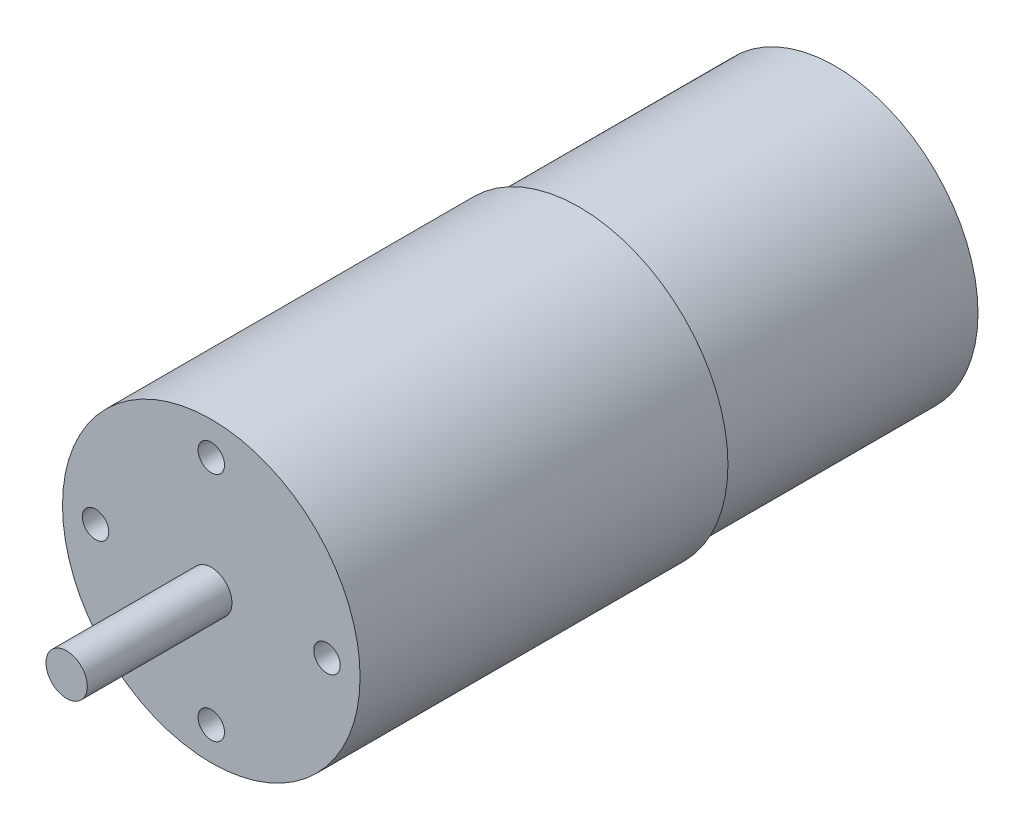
ISO-10303-21;
HEADER;
FILE_DESCRIPTION(('STEP AP214'),'2;1');
FILE_NAME('part.step','',(''),(''),'','','');
FILE_SCHEMA(('AUTOMOTIVE_DESIGN { 1 0 10303 214 1 1 1 1 }'));
ENDSEC;
DATA;
#1=APPLICATION_CONTEXT('core data for automotive mechanical design processes');
#2=APPLICATION_PROTOCOL_DEFINITION('international standard','automotive_design',2000,#1);
#3=PRODUCT_CONTEXT('',#1,'mechanical');
#4=PRODUCT('Part','Part','',(#3));
#5=PRODUCT_RELATED_PRODUCT_CATEGORY('part','',(#4));
#6=PRODUCT_DEFINITION_FORMATION('','',#4);
#7=PRODUCT_DEFINITION_CONTEXT('part definition',#1,'design');
#8=PRODUCT_DEFINITION('design','',#6,#7);
#9=PRODUCT_DEFINITION_SHAPE('','',#8);
#10=(LENGTH_UNIT() NAMED_UNIT(*) SI_UNIT(.MILLI.,.METRE.));
#11=(NAMED_UNIT(*) PLANE_ANGLE_UNIT() SI_UNIT($,.RADIAN.));
#12=(NAMED_UNIT(*) SI_UNIT($,.STERADIAN.) SOLID_ANGLE_UNIT());
#13=UNCERTAINTY_MEASURE_WITH_UNIT(LENGTH_MEASURE(1.E-05),#10,'distance_accuracy_value','');
#14=(GEOMETRIC_REPRESENTATION_CONTEXT(3) GLOBAL_UNCERTAINTY_ASSIGNED_CONTEXT((#13)) GLOBAL_UNIT_ASSIGNED_CONTEXT((#10,
#11,#12)) REPRESENTATION_CONTEXT('',''));
#15=CARTESIAN_POINT('',(0.,0.,0.));
#16=DIRECTION('',(0.,0.,1.));
#17=DIRECTION('',(1.,0.,0.));
#18=AXIS2_PLACEMENT_3D('',#15,#16,#17);
#19=CARTESIAN_POINT('',(0.,0.,0.));
#20=DIRECTION('',(0.,0.,1.));
#21=DIRECTION('',(1.,0.,0.));
#22=AXIS2_PLACEMENT_3D('',#19,#20,#21);
#23=PLANE('',#22);
#24=DIRECTION('',(0.,-1.,0.));
#25=VECTOR('',#24,1.);
#26=CARTESIAN_POINT('',(-11.,0.5,0.));
#27=LINE('',#26,#25);
#28=CARTESIAN_POINT('',(-11.,0.5,0.));
#29=VERTEX_POINT('',#28);
#30=CARTESIAN_POINT('',(-11.,-0.5,0.));
#31=VERTEX_POINT('',#30);
#32=EDGE_CURVE('E157',#29,#31,#27,.T.);
#33=ORIENTED_EDGE('',*,*,#32,.T.);
#34=DIRECTION('',(1.,0.,0.));
#35=VECTOR('',#34,1.);
#36=CARTESIAN_POINT('',(-11.,-0.5,0.));
#37=LINE('',#36,#35);
#38=CARTESIAN_POINT('',(-9.,-0.5,0.));
#39=VERTEX_POINT('',#38);
#40=EDGE_CURVE('E149',#31,#39,#37,.T.);
#41=ORIENTED_EDGE('',*,*,#40,.T.);
#42=DIRECTION('',(0.,-1.,0.));
#43=VECTOR('',#42,1.);
#44=CARTESIAN_POINT('',(-9.,0.5,0.));
#45=LINE('',#44,#43);
#46=CARTESIAN_POINT('',(-9.,0.5,0.));
#47=VERTEX_POINT('',#46);
#48=EDGE_CURVE('E154',#47,#39,#45,.T.);
#49=ORIENTED_EDGE('',*,*,#48,.F.);
#50=DIRECTION('',(1.,0.,0.));
#51=VECTOR('',#50,1.);
#52=CARTESIAN_POINT('',(-11.,0.5,0.));
#53=LINE('',#52,#51);
#54=EDGE_CURVE('E138',#29,#47,#53,.T.);
#55=ORIENTED_EDGE('',*,*,#54,.F.);
#56=EDGE_LOOP('',(#33,#41,#49,#55));
#57=FACE_BOUND('',#56,.T.);
#58=CARTESIAN_POINT('',(0.,0.,0.));
#59=DIRECTION('',(0.,0.,1.));
#60=DIRECTION('',(1.,0.,0.));
#61=AXIS2_PLACEMENT_3D('',#58,#59,#60);
#62=CIRCLE('',#61,17.25);
#63=CARTESIAN_POINT('',(17.25,0.,0.));
#64=VERTEX_POINT('',#63);
#65=EDGE_CURVE('E38',#64,#64,#62,.T.);
#66=ORIENTED_EDGE('',*,*,#65,.F.);
#67=EDGE_LOOP('',(#66));
#68=FACE_BOUND('',#67,.T.);
#69=DIRECTION('',(0.,-1.,0.));
#70=VECTOR('',#69,1.);
#71=CARTESIAN_POINT('',(9.,0.5,0.));
#72=LINE('',#71,#70);
#73=CARTESIAN_POINT('',(9.,0.5,0.));
#74=VERTEX_POINT('',#73);
#75=CARTESIAN_POINT('',(9.,-0.5,0.));
#76=VERTEX_POINT('',#75);
#77=EDGE_CURVE('E54',#74,#76,#72,.T.);
#78=ORIENTED_EDGE('',*,*,#77,.T.);
#79=DIRECTION('',(1.,0.,0.));
#80=VECTOR('',#79,1.);
#81=CARTESIAN_POINT('',(11.,-0.5,0.));
#82=LINE('',#81,#80);
#83=CARTESIAN_POINT('',(11.,-0.5,0.));
#84=VERTEX_POINT('',#83);
#85=EDGE_CURVE('E478',#76,#84,#82,.T.);
#86=ORIENTED_EDGE('',*,*,#85,.T.);
#87=DIRECTION('',(0.,-1.,0.));
#88=VECTOR('',#87,1.);
#89=CARTESIAN_POINT('',(11.,0.5,0.));
#90=LINE('',#89,#88);
#91=CARTESIAN_POINT('',(11.,0.5,0.));
#92=VERTEX_POINT('',#91);
#93=EDGE_CURVE('E124',#92,#84,#90,.T.);
#94=ORIENTED_EDGE('',*,*,#93,.F.);
#95=DIRECTION('',(1.,0.,0.));
#96=VECTOR('',#95,1.);
#97=CARTESIAN_POINT('',(11.,0.5,0.));
#98=LINE('',#97,#96);
#99=EDGE_CURVE('E49',#74,#92,#98,.T.);
#100=ORIENTED_EDGE('',*,*,#99,.F.);
#101=EDGE_LOOP('',(#78,#86,#94,#100));
#102=FACE_BOUND('',#101,.T.);
#103=ADVANCED_FACE('F34',(#57,#68,#102),#23,.F.);
#104=CARTESIAN_POINT('',(0.,0.,31.));
#105=DIRECTION('',(0.,0.,-1.));
#106=DIRECTION('',(-1.,0.,0.));
#107=AXIS2_PLACEMENT_3D('',#104,#105,#106);
#108=CYLINDRICAL_SURFACE('',#107,17.25);
#109=CARTESIAN_POINT('',(0.,0.,31.));
#110=DIRECTION('',(0.,0.,1.));
#111=DIRECTION('',(1.,0.,0.));
#112=AXIS2_PLACEMENT_3D('',#109,#110,#111);
#113=CIRCLE('',#112,17.25);
#114=CARTESIAN_POINT('',(17.25,0.,31.));
#115=VERTEX_POINT('',#114);
#116=EDGE_CURVE('E11',#115,#115,#113,.T.);
#117=ORIENTED_EDGE('',*,*,#116,.F.);
#118=EDGE_LOOP('',(#117));
#119=FACE_BOUND('',#118,.T.);
#120=ORIENTED_EDGE('',*,*,#65,.T.);
#121=EDGE_LOOP('',(#120));
#122=FACE_BOUND('',#121,.T.);
#123=ADVANCED_FACE('F36',(#119,#122),#108,.T.);
#124=CARTESIAN_POINT('',(0.,0.,75.5));
#125=DIRECTION('',(0.,0.,-1.));
#126=DIRECTION('',(-1.,0.,0.));
#127=AXIS2_PLACEMENT_3D('',#124,#125,#126);
#128=CYLINDRICAL_SURFACE('',#127,18.);
#129=CARTESIAN_POINT('',(0.,0.,75.5));
#130=DIRECTION('',(0.,0.,1.));
#131=DIRECTION('',(1.,0.,0.));
#132=AXIS2_PLACEMENT_3D('',#129,#130,#131);
#133=CIRCLE('',#132,18.);
#134=CARTESIAN_POINT('',(18.,0.,75.5));
#135=VERTEX_POINT('',#134);
#136=EDGE_CURVE('E193',#135,#135,#133,.T.);
#137=ORIENTED_EDGE('',*,*,#136,.F.);
#138=EDGE_LOOP('',(#137));
#139=FACE_BOUND('',#138,.T.);
#140=CARTESIAN_POINT('',(0.,0.,31.));
#141=DIRECTION('',(0.,0.,1.));
#142=DIRECTION('',(1.,0.,0.));
#143=AXIS2_PLACEMENT_3D('',#140,#141,#142);
#144=CIRCLE('',#143,18.);
#145=CARTESIAN_POINT('',(18.,0.,31.));
#146=VERTEX_POINT('',#145);
#147=EDGE_CURVE('E190',#146,#146,#144,.T.);
#148=ORIENTED_EDGE('',*,*,#147,.T.);
#149=EDGE_LOOP('',(#148));
#150=FACE_BOUND('',#149,.T.);
#151=ADVANCED_FACE('F199',(#139,#150),#128,.T.);
#152=CARTESIAN_POINT('',(0.,0.,75.5));
#153=DIRECTION('',(0.,0.,1.));
#154=DIRECTION('',(1.,0.,0.));
#155=AXIS2_PLACEMENT_3D('',#152,#153,#154);
#156=PLANE('',#155);
#157=CARTESIAN_POINT('',(0.,14.,75.5));
#158=DIRECTION('',(0.,0.,1.));
#159=DIRECTION('',(1.,0.,0.));
#160=AXIS2_PLACEMENT_3D('',#157,#158,#159);
#161=CIRCLE('',#160,1.6);
#162=CARTESIAN_POINT('',(1.6,14.,75.5));
#163=VERTEX_POINT('',#162);
#164=EDGE_CURVE('E167',#163,#163,#161,.T.);
#165=ORIENTED_EDGE('',*,*,#164,.F.);
#166=EDGE_LOOP('',(#165));
#167=FACE_BOUND('',#166,.T.);
#168=CARTESIAN_POINT('',(14.0000000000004,3.9618942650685E-13,75.5));
#169=DIRECTION('',(0.,0.,1.));
#170=DIRECTION('',(1.,0.,0.));
#171=AXIS2_PLACEMENT_3D('',#168,#169,#170);
#172=CIRCLE('',#171,1.60000000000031);
#173=CARTESIAN_POINT('',(15.6000000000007,3.9618942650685E-13,75.5));
#174=VERTEX_POINT('',#173);
#175=EDGE_CURVE('E173',#174,#174,#172,.T.);
#176=ORIENTED_EDGE('',*,*,#175,.F.);
#177=EDGE_LOOP('',(#176));
#178=FACE_BOUND('',#177,.T.);
#179=CARTESIAN_POINT('',(7.923788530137E-13,-14.,75.5));
#180=DIRECTION('',(0.,0.,1.));
#181=DIRECTION('',(1.,0.,0.));
#182=AXIS2_PLACEMENT_3D('',#179,#180,#181);
#183=CIRCLE('',#182,1.60000000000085);
#184=CARTESIAN_POINT('',(1.60000000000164,-14.,75.5));
#185=VERTEX_POINT('',#184);
#186=EDGE_CURVE('E179',#185,#185,#183,.T.);
#187=ORIENTED_EDGE('',*,*,#186,.F.);
#188=EDGE_LOOP('',(#187));
#189=FACE_BOUND('',#188,.T.);
#190=CARTESIAN_POINT('',(-13.9999999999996,-3.97903932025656E-13,75.5));
#191=DIRECTION('',(0.,0.,1.));
#192=DIRECTION('',(1.,0.,0.));
#193=AXIS2_PLACEMENT_3D('',#190,#191,#192);
#194=CIRCLE('',#193,1.60000000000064);
#195=CARTESIAN_POINT('',(-12.399999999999,-3.97903932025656E-13,75.5));
#196=VERTEX_POINT('',#195);
#197=EDGE_CURVE('E162',#196,#196,#194,.T.);
#198=ORIENTED_EDGE('',*,*,#197,.F.);
#199=EDGE_LOOP('',(#198));
#200=FACE_BOUND('',#199,.T.);
#201=CARTESIAN_POINT('',(0.,0.,75.5));
#202=DIRECTION('',(0.,0.,1.));
#203=DIRECTION('',(1.,0.,0.));
#204=AXIS2_PLACEMENT_3D('',#201,#202,#203);
#205=CIRCLE('',#204,2.5);
#206=CARTESIAN_POINT('',(2.5,0.,75.5));
#207=VERTEX_POINT('',#206);
#208=EDGE_CURVE('E166',#207,#207,#205,.T.);
#209=ORIENTED_EDGE('',*,*,#208,.F.);
#210=EDGE_LOOP('',(#209));
#211=FACE_BOUND('',#210,.T.);
#212=ORIENTED_EDGE('',*,*,#136,.T.);
#213=EDGE_LOOP('',(#212));
#214=FACE_BOUND('',#213,.T.);
#215=ADVANCED_FACE('F204',(#167,#178,#189,#200,#211,#214),#156,.T.);
#216=CARTESIAN_POINT('',(0.,0.,31.));
#217=DIRECTION('',(0.,0.,1.));
#218=DIRECTION('',(1.,0.,0.));
#219=AXIS2_PLACEMENT_3D('',#216,#217,#218);
#220=PLANE('',#219);
#221=ORIENTED_EDGE('',*,*,#116,.T.);
#222=EDGE_LOOP('',(#221));
#223=FACE_BOUND('',#222,.T.);
#224=ORIENTED_EDGE('',*,*,#147,.F.);
#225=EDGE_LOOP('',(#224));
#226=FACE_BOUND('',#225,.T.);
#227=ADVANCED_FACE('F201',(#223,#226),#220,.F.);
#228=CARTESIAN_POINT('',(0.,0.,93.));
#229=DIRECTION('',(0.,0.,-1.));
#230=DIRECTION('',(-1.,0.,0.));
#231=AXIS2_PLACEMENT_3D('',#228,#229,#230);
#232=CYLINDRICAL_SURFACE('',#231,2.5);
#233=CARTESIAN_POINT('',(0.,0.,93.));
#234=DIRECTION('',(0.,0.,1.));
#235=DIRECTION('',(1.,0.,0.));
#236=AXIS2_PLACEMENT_3D('',#233,#234,#235);
#237=CIRCLE('',#236,2.5);
#238=CARTESIAN_POINT('',(2.5,0.,93.));
#239=VERTEX_POINT('',#238);
#240=EDGE_CURVE('E187',#239,#239,#237,.T.);
#241=ORIENTED_EDGE('',*,*,#240,.F.);
#242=EDGE_LOOP('',(#241));
#243=FACE_BOUND('',#242,.T.);
#244=ORIENTED_EDGE('',*,*,#208,.T.);
#245=EDGE_LOOP('',(#244));
#246=FACE_BOUND('',#245,.T.);
#247=ADVANCED_FACE('F203',(#243,#246),#232,.T.);
#248=CARTESIAN_POINT('',(0.,0.,93.));
#249=DIRECTION('',(0.,0.,1.));
#250=DIRECTION('',(1.,0.,0.));
#251=AXIS2_PLACEMENT_3D('',#248,#249,#250);
#252=PLANE('',#251);
#253=ORIENTED_EDGE('',*,*,#240,.T.);
#254=EDGE_LOOP('',(#253));
#255=FACE_BOUND('',#254,.T.);
#256=ADVANCED_FACE('F211',(#255),#252,.T.);
#257=CARTESIAN_POINT('',(-13.9999999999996,-3.97903932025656E-13,70.5));
#258=DIRECTION('',(0.,0.,1.));
#259=DIRECTION('',(1.,0.,0.));
#260=AXIS2_PLACEMENT_3D('',#257,#258,#259);
#261=CYLINDRICAL_SURFACE('',#260,1.60000000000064);
#262=CARTESIAN_POINT('',(-13.9999999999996,-3.97903932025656E-13,70.5));
#263=DIRECTION('',(0.,0.,1.));
#264=DIRECTION('',(1.,0.,0.));
#265=AXIS2_PLACEMENT_3D('',#262,#263,#264);
#266=CIRCLE('',#265,1.60000000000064);
#267=CARTESIAN_POINT('',(-12.399999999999,-3.97903932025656E-13,70.5));
#268=VERTEX_POINT('',#267);
#269=EDGE_CURVE('E182',#268,#268,#266,.T.);
#270=ORIENTED_EDGE('',*,*,#269,.F.);
#271=EDGE_LOOP('',(#270));
#272=FACE_BOUND('',#271,.T.);
#273=ORIENTED_EDGE('',*,*,#197,.T.);
#274=EDGE_LOOP('',(#273));
#275=FACE_BOUND('',#274,.T.);
#276=ADVANCED_FACE('F247',(#272,#275),#261,.F.);
#277=CARTESIAN_POINT('',(-13.9999999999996,-3.97903932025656E-13,70.5));
#278=DIRECTION('',(0.,0.,1.));
#279=DIRECTION('',(1.,0.,0.));
#280=AXIS2_PLACEMENT_3D('',#277,#278,#279);
#281=PLANE('',#280);
#282=ORIENTED_EDGE('',*,*,#269,.T.);
#283=EDGE_LOOP('',(#282));
#284=FACE_BOUND('',#283,.T.);
#285=ADVANCED_FACE('F252',(#284),#281,.T.);
#286=CARTESIAN_POINT('',(7.923788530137E-13,-14.,70.5));
#287=DIRECTION('',(0.,0.,1.));
#288=DIRECTION('',(1.,0.,0.));
#289=AXIS2_PLACEMENT_3D('',#286,#287,#288);
#290=CYLINDRICAL_SURFACE('',#289,1.60000000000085);
#291=CARTESIAN_POINT('',(7.923788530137E-13,-14.,70.5));
#292=DIRECTION('',(0.,0.,1.));
#293=DIRECTION('',(1.,0.,0.));
#294=AXIS2_PLACEMENT_3D('',#291,#292,#293);
#295=CIRCLE('',#294,1.60000000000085);
#296=CARTESIAN_POINT('',(1.60000000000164,-14.,70.5));
#297=VERTEX_POINT('',#296);
#298=EDGE_CURVE('E176',#297,#297,#295,.T.);
#299=ORIENTED_EDGE('',*,*,#298,.F.);
#300=EDGE_LOOP('',(#299));
#301=FACE_BOUND('',#300,.T.);
#302=ORIENTED_EDGE('',*,*,#186,.T.);
#303=EDGE_LOOP('',(#302));
#304=FACE_BOUND('',#303,.T.);
#305=ADVANCED_FACE('F262',(#301,#304),#290,.F.);
#306=CARTESIAN_POINT('',(7.923788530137E-13,-14.,70.5));
#307=DIRECTION('',(0.,0.,1.));
#308=DIRECTION('',(1.,0.,0.));
#309=AXIS2_PLACEMENT_3D('',#306,#307,#308);
#310=PLANE('',#309);
#311=ORIENTED_EDGE('',*,*,#298,.T.);
#312=EDGE_LOOP('',(#311));
#313=FACE_BOUND('',#312,.T.);
#314=ADVANCED_FACE('F272',(#313),#310,.T.);
#315=CARTESIAN_POINT('',(14.0000000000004,3.9618942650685E-13,70.5));
#316=DIRECTION('',(0.,0.,1.));
#317=DIRECTION('',(1.,0.,0.));
#318=AXIS2_PLACEMENT_3D('',#315,#316,#317);
#319=CYLINDRICAL_SURFACE('',#318,1.60000000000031);
#320=CARTESIAN_POINT('',(14.0000000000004,3.9618942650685E-13,70.5));
#321=DIRECTION('',(0.,0.,1.));
#322=DIRECTION('',(1.,0.,0.));
#323=AXIS2_PLACEMENT_3D('',#320,#321,#322);
#324=CIRCLE('',#323,1.60000000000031);
#325=CARTESIAN_POINT('',(15.6000000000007,3.9618942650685E-13,70.5));
#326=VERTEX_POINT('',#325);
#327=EDGE_CURVE('E170',#326,#326,#324,.T.);
#328=ORIENTED_EDGE('',*,*,#327,.F.);
#329=EDGE_LOOP('',(#328));
#330=FACE_BOUND('',#329,.T.);
#331=ORIENTED_EDGE('',*,*,#175,.T.);
#332=EDGE_LOOP('',(#331));
#333=FACE_BOUND('',#332,.T.);
#334=ADVANCED_FACE('F282',(#330,#333),#319,.F.);
#335=CARTESIAN_POINT('',(14.0000000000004,3.9618942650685E-13,70.5));
#336=DIRECTION('',(0.,0.,1.));
#337=DIRECTION('',(1.,0.,0.));
#338=AXIS2_PLACEMENT_3D('',#335,#336,#337);
#339=PLANE('',#338);
#340=ORIENTED_EDGE('',*,*,#327,.T.);
#341=EDGE_LOOP('',(#340));
#342=FACE_BOUND('',#341,.T.);
#343=ADVANCED_FACE('F292',(#342),#339,.T.);
#344=CARTESIAN_POINT('',(0.,14.,70.5));
#345=DIRECTION('',(0.,0.,1.));
#346=DIRECTION('',(1.,0.,0.));
#347=AXIS2_PLACEMENT_3D('',#344,#345,#346);
#348=CYLINDRICAL_SURFACE('',#347,1.6);
#349=CARTESIAN_POINT('',(0.,14.,70.5));
#350=DIRECTION('',(0.,0.,1.));
#351=DIRECTION('',(1.,0.,0.));
#352=AXIS2_PLACEMENT_3D('',#349,#350,#351);
#353=CIRCLE('',#352,1.6);
#354=CARTESIAN_POINT('',(1.6,14.,70.5));
#355=VERTEX_POINT('',#354);
#356=EDGE_CURVE('E163',#355,#355,#353,.T.);
#357=ORIENTED_EDGE('',*,*,#356,.F.);
#358=EDGE_LOOP('',(#357));
#359=FACE_BOUND('',#358,.T.);
#360=ORIENTED_EDGE('',*,*,#164,.T.);
#361=EDGE_LOOP('',(#360));
#362=FACE_BOUND('',#361,.T.);
#363=ADVANCED_FACE('F302',(#359,#362),#348,.F.);
#364=CARTESIAN_POINT('',(0.,14.,70.5));
#365=DIRECTION('',(0.,0.,1.));
#366=DIRECTION('',(1.,0.,0.));
#367=AXIS2_PLACEMENT_3D('',#364,#365,#366);
#368=PLANE('',#367);
#369=ORIENTED_EDGE('',*,*,#356,.T.);
#370=EDGE_LOOP('',(#369));
#371=FACE_BOUND('',#370,.T.);
#372=ADVANCED_FACE('F312',(#371),#368,.T.);
#373=CARTESIAN_POINT('',(-10.,0.5,-2.));
#374=DIRECTION('',(0.,1.,0.));
#375=DIRECTION('',(0.,0.,1.));
#376=AXIS2_PLACEMENT_3D('',#373,#374,#375);
#377=PLANE('',#376);
#378=CARTESIAN_POINT('',(-10.,0.5,-2.));
#379=DIRECTION('',(0.,1.,0.));
#380=DIRECTION('',(0.,0.,1.));
#381=AXIS2_PLACEMENT_3D('',#378,#379,#380);
#382=CIRCLE('',#381,1.);
#383=CARTESIAN_POINT('',(-9.,0.5,-2.));
#384=VERTEX_POINT('',#383);
#385=CARTESIAN_POINT('',(-11.,0.5,-2.));
#386=VERTEX_POINT('',#385);
#387=EDGE_CURVE('E131',#384,#386,#382,.T.);
#388=ORIENTED_EDGE('',*,*,#387,.T.);
#389=DIRECTION('',(0.,0.,1.));
#390=VECTOR('',#389,1.);
#391=CARTESIAN_POINT('',(-11.,0.5,-2.));
#392=LINE('',#391,#390);
#393=EDGE_CURVE('E134',#386,#29,#392,.T.);
#394=ORIENTED_EDGE('',*,*,#393,.T.);
#395=ORIENTED_EDGE('',*,*,#54,.T.);
#396=DIRECTION('',(0.,0.,-1.));
#397=VECTOR('',#396,1.);
#398=CARTESIAN_POINT('',(-9.,0.5,0.));
#399=LINE('',#398,#397);
#400=EDGE_CURVE('E141',#47,#384,#399,.T.);
#401=ORIENTED_EDGE('',*,*,#400,.T.);
#402=EDGE_LOOP('',(#388,#394,#395,#401));
#403=FACE_BOUND('',#402,.T.);
#404=CARTESIAN_POINT('',(-10.,0.5,-2.));
#405=DIRECTION('',(0.,1.,0.));
#406=DIRECTION('',(0.,0.,1.));
#407=AXIS2_PLACEMENT_3D('',#404,#405,#406);
#408=CIRCLE('',#407,0.75);
#409=CARTESIAN_POINT('',(-10.,0.5,-1.25));
#410=VERTEX_POINT('',#409);
#411=EDGE_CURVE('E122',#410,#410,#408,.T.);
#412=ORIENTED_EDGE('',*,*,#411,.F.);
#413=EDGE_LOOP('',(#412));
#414=FACE_BOUND('',#413,.T.);
#415=ADVANCED_FACE('F321',(#403,#414),#377,.T.);
#416=CARTESIAN_POINT('',(-10.,-0.5,-2.));
#417=DIRECTION('',(0.,1.,0.));
#418=DIRECTION('',(0.,0.,1.));
#419=AXIS2_PLACEMENT_3D('',#416,#417,#418);
#420=PLANE('',#419);
#421=CARTESIAN_POINT('',(-10.,-0.5,-2.));
#422=DIRECTION('',(0.,1.,0.));
#423=DIRECTION('',(0.,0.,1.));
#424=AXIS2_PLACEMENT_3D('',#421,#422,#423);
#425=CIRCLE('',#424,1.);
#426=CARTESIAN_POINT('',(-9.,-0.5,-2.));
#427=VERTEX_POINT('',#426);
#428=CARTESIAN_POINT('',(-11.,-0.5,-2.));
#429=VERTEX_POINT('',#428);
#430=EDGE_CURVE('E129',#427,#429,#425,.T.);
#431=ORIENTED_EDGE('',*,*,#430,.F.);
#432=DIRECTION('',(0.,0.,-1.));
#433=VECTOR('',#432,1.);
#434=CARTESIAN_POINT('',(-9.,-0.5,0.));
#435=LINE('',#434,#433);
#436=EDGE_CURVE('E135',#39,#427,#435,.T.);
#437=ORIENTED_EDGE('',*,*,#436,.F.);
#438=ORIENTED_EDGE('',*,*,#40,.F.);
#439=DIRECTION('',(0.,0.,1.));
#440=VECTOR('',#439,1.);
#441=CARTESIAN_POINT('',(-11.,-0.5,-2.));
#442=LINE('',#441,#440);
#443=EDGE_CURVE('E146',#429,#31,#442,.T.);
#444=ORIENTED_EDGE('',*,*,#443,.F.);
#445=EDGE_LOOP('',(#431,#437,#438,#444));
#446=FACE_BOUND('',#445,.T.);
#447=CARTESIAN_POINT('',(-10.,-0.5,-2.));
#448=DIRECTION('',(0.,1.,0.));
#449=DIRECTION('',(0.,0.,1.));
#450=AXIS2_PLACEMENT_3D('',#447,#448,#449);
#451=CIRCLE('',#450,0.75);
#452=CARTESIAN_POINT('',(-10.,-0.5,-1.25));
#453=VERTEX_POINT('',#452);
#454=EDGE_CURVE('E119',#453,#453,#451,.T.);
#455=ORIENTED_EDGE('',*,*,#454,.T.);
#456=EDGE_LOOP('',(#455));
#457=FACE_BOUND('',#456,.T.);
#458=ADVANCED_FACE('F336',(#446,#457),#420,.F.);
#459=CARTESIAN_POINT('',(-10.,0.5,-2.));
#460=DIRECTION('',(0.,-1.,0.));
#461=DIRECTION('',(0.,0.,-1.));
#462=AXIS2_PLACEMENT_3D('',#459,#460,#461);
#463=CYLINDRICAL_SURFACE('',#462,1.);
#464=ORIENTED_EDGE('',*,*,#430,.T.);
#465=DIRECTION('',(0.,-1.,0.));
#466=VECTOR('',#465,1.);
#467=CARTESIAN_POINT('',(-11.,0.5,-2.));
#468=LINE('',#467,#466);
#469=EDGE_CURVE('E159',#386,#429,#468,.T.);
#470=ORIENTED_EDGE('',*,*,#469,.F.);
#471=ORIENTED_EDGE('',*,*,#387,.F.);
#472=DIRECTION('',(0.,-1.,0.));
#473=VECTOR('',#472,1.);
#474=CARTESIAN_POINT('',(-9.,0.5,-2.));
#475=LINE('',#474,#473);
#476=EDGE_CURVE('E143',#384,#427,#475,.T.);
#477=ORIENTED_EDGE('',*,*,#476,.T.);
#478=EDGE_LOOP('',(#464,#470,#471,#477));
#479=FACE_BOUND('',#478,.T.);
#480=ADVANCED_FACE('F346',(#479),#463,.T.);
#481=CARTESIAN_POINT('',(-11.,0.5,-2.));
#482=DIRECTION('',(1.,0.,0.));
#483=DIRECTION('',(0.,0.,-1.));
#484=AXIS2_PLACEMENT_3D('',#481,#482,#483);
#485=PLANE('',#484);
#486=ORIENTED_EDGE('',*,*,#443,.T.);
#487=ORIENTED_EDGE('',*,*,#32,.F.);
#488=ORIENTED_EDGE('',*,*,#393,.F.);
#489=ORIENTED_EDGE('',*,*,#469,.T.);
#490=EDGE_LOOP('',(#486,#487,#488,#489));
#491=FACE_BOUND('',#490,.T.);
#492=ADVANCED_FACE('F356',(#491),#485,.F.);
#493=CARTESIAN_POINT('',(-9.,0.5,0.));
#494=DIRECTION('',(-1.,0.,0.));
#495=DIRECTION('',(0.,0.,1.));
#496=AXIS2_PLACEMENT_3D('',#493,#494,#495);
#497=PLANE('',#496);
#498=ORIENTED_EDGE('',*,*,#436,.T.);
#499=ORIENTED_EDGE('',*,*,#476,.F.);
#500=ORIENTED_EDGE('',*,*,#400,.F.);
#501=ORIENTED_EDGE('',*,*,#48,.T.);
#502=EDGE_LOOP('',(#498,#499,#500,#501));
#503=FACE_BOUND('',#502,.T.);
#504=ADVANCED_FACE('F366',(#503),#497,.F.);
#505=CARTESIAN_POINT('',(-10.,0.5,-2.));
#506=DIRECTION('',(0.,-1.,0.));
#507=DIRECTION('',(0.,0.,-1.));
#508=AXIS2_PLACEMENT_3D('',#505,#506,#507);
#509=CYLINDRICAL_SURFACE('',#508,0.75);
#510=ORIENTED_EDGE('',*,*,#411,.T.);
#511=EDGE_LOOP('',(#510));
#512=FACE_BOUND('',#511,.T.);
#513=ORIENTED_EDGE('',*,*,#454,.F.);
#514=EDGE_LOOP('',(#513));
#515=FACE_BOUND('',#514,.T.);
#516=ADVANCED_FACE('F376',(#512,#515),#509,.F.);
#517=CARTESIAN_POINT('',(10.,0.5,-2.));
#518=DIRECTION('',(0.,-1.,0.));
#519=DIRECTION('',(0.,0.,-1.));
#520=AXIS2_PLACEMENT_3D('',#517,#518,#519);
#521=PLANE('',#520);
#522=CARTESIAN_POINT('',(10.,0.5,-2.));
#523=DIRECTION('',(0.,1.,0.));
#524=DIRECTION('',(0.,0.,-1.));
#525=AXIS2_PLACEMENT_3D('',#522,#523,#524);
#526=CIRCLE('',#525,1.);
#527=CARTESIAN_POINT('',(11.,0.5,-2.));
#528=VERTEX_POINT('',#527);
#529=CARTESIAN_POINT('',(9.,0.5,-2.));
#530=VERTEX_POINT('',#529);
#531=EDGE_CURVE('E104',#528,#530,#526,.T.);
#532=ORIENTED_EDGE('',*,*,#531,.T.);
#533=DIRECTION('',(0.,0.,1.));
#534=VECTOR('',#533,1.);
#535=CARTESIAN_POINT('',(9.,0.5,0.));
#536=LINE('',#535,#534);
#537=EDGE_CURVE('E97',#530,#74,#536,.T.);
#538=ORIENTED_EDGE('',*,*,#537,.T.);
#539=ORIENTED_EDGE('',*,*,#99,.T.);
#540=DIRECTION('',(0.,0.,-1.));
#541=VECTOR('',#540,1.);
#542=CARTESIAN_POINT('',(11.,0.5,-2.));
#543=LINE('',#542,#541);
#544=EDGE_CURVE('E110',#92,#528,#543,.T.);
#545=ORIENTED_EDGE('',*,*,#544,.T.);
#546=EDGE_LOOP('',(#532,#538,#539,#545));
#547=FACE_BOUND('',#546,.T.);
#548=CARTESIAN_POINT('',(10.,0.5,-2.));
#549=DIRECTION('',(0.,1.,0.));
#550=DIRECTION('',(0.,0.,-1.));
#551=AXIS2_PLACEMENT_3D('',#548,#549,#550);
#552=CIRCLE('',#551,0.75);
#553=CARTESIAN_POINT('',(10.,0.5,-2.75));
#554=VERTEX_POINT('',#553);
#555=EDGE_CURVE('E464',#554,#554,#552,.T.);
#556=ORIENTED_EDGE('',*,*,#555,.F.);
#557=EDGE_LOOP('',(#556));
#558=FACE_BOUND('',#557,.T.);
#559=ADVANCED_FACE('F107',(#547,#558),#521,.F.);
#560=CARTESIAN_POINT('',(10.,-0.5,-2.));
#561=DIRECTION('',(0.,-1.,0.));
#562=DIRECTION('',(0.,0.,-1.));
#563=AXIS2_PLACEMENT_3D('',#560,#561,#562);
#564=PLANE('',#563);
#565=CARTESIAN_POINT('',(10.,-0.5,-2.));
#566=DIRECTION('',(0.,1.,0.));
#567=DIRECTION('',(0.,0.,-1.));
#568=AXIS2_PLACEMENT_3D('',#565,#566,#567);
#569=CIRCLE('',#568,1.);
#570=CARTESIAN_POINT('',(11.,-0.5,-2.));
#571=VERTEX_POINT('',#570);
#572=CARTESIAN_POINT('',(9.,-0.5,-2.));
#573=VERTEX_POINT('',#572);
#574=EDGE_CURVE('E118',#571,#573,#569,.T.);
#575=ORIENTED_EDGE('',*,*,#574,.F.);
#576=DIRECTION('',(0.,0.,-1.));
#577=VECTOR('',#576,1.);
#578=CARTESIAN_POINT('',(11.,-0.5,-2.));
#579=LINE('',#578,#577);
#580=EDGE_CURVE('E114',#84,#571,#579,.T.);
#581=ORIENTED_EDGE('',*,*,#580,.F.);
#582=ORIENTED_EDGE('',*,*,#85,.F.);
#583=DIRECTION('',(0.,0.,1.));
#584=VECTOR('',#583,1.);
#585=CARTESIAN_POINT('',(9.,-0.5,0.));
#586=LINE('',#585,#584);
#587=EDGE_CURVE('E476',#573,#76,#586,.T.);
#588=ORIENTED_EDGE('',*,*,#587,.F.);
#589=EDGE_LOOP('',(#575,#581,#582,#588));
#590=FACE_BOUND('',#589,.T.);
#591=CARTESIAN_POINT('',(10.,-0.5,-2.));
#592=DIRECTION('',(0.,1.,0.));
#593=DIRECTION('',(0.,0.,-1.));
#594=AXIS2_PLACEMENT_3D('',#591,#592,#593);
#595=CIRCLE('',#594,0.75);
#596=CARTESIAN_POINT('',(10.,-0.5,-2.75));
#597=VERTEX_POINT('',#596);
#598=EDGE_CURVE('E467',#597,#597,#595,.T.);
#599=ORIENTED_EDGE('',*,*,#598,.T.);
#600=EDGE_LOOP('',(#599));
#601=FACE_BOUND('',#600,.T.);
#602=ADVANCED_FACE('F395',(#590,#601),#564,.T.);
#603=CARTESIAN_POINT('',(10.,0.5,-2.));
#604=DIRECTION('',(0.,-1.,0.));
#605=DIRECTION('',(0.,0.,-1.));
#606=AXIS2_PLACEMENT_3D('',#603,#604,#605);
#607=CYLINDRICAL_SURFACE('',#606,1.);
#608=ORIENTED_EDGE('',*,*,#574,.T.);
#609=DIRECTION('',(0.,-1.,0.));
#610=VECTOR('',#609,1.);
#611=CARTESIAN_POINT('',(9.,0.5,-2.));
#612=LINE('',#611,#610);
#613=EDGE_CURVE('E101',#530,#573,#612,.T.);
#614=ORIENTED_EDGE('',*,*,#613,.F.);
#615=ORIENTED_EDGE('',*,*,#531,.F.);
#616=DIRECTION('',(0.,-1.,0.));
#617=VECTOR('',#616,1.);
#618=CARTESIAN_POINT('',(11.,0.5,-2.));
#619=LINE('',#618,#617);
#620=EDGE_CURVE('E474',#528,#571,#619,.T.);
#621=ORIENTED_EDGE('',*,*,#620,.T.);
#622=EDGE_LOOP('',(#608,#614,#615,#621));
#623=FACE_BOUND('',#622,.T.);
#624=ADVANCED_FACE('F116',(#623),#607,.T.);
#625=CARTESIAN_POINT('',(9.,0.5,0.));
#626=DIRECTION('',(1.,0.,0.));
#627=DIRECTION('',(0.,0.,-1.));
#628=AXIS2_PLACEMENT_3D('',#625,#626,#627);
#629=PLANE('',#628);
#630=ORIENTED_EDGE('',*,*,#587,.T.);
#631=ORIENTED_EDGE('',*,*,#77,.F.);
#632=ORIENTED_EDGE('',*,*,#537,.F.);
#633=ORIENTED_EDGE('',*,*,#613,.T.);
#634=EDGE_LOOP('',(#630,#631,#632,#633));
#635=FACE_BOUND('',#634,.T.);
#636=ADVANCED_FACE('F99',(#635),#629,.F.);
#637=CARTESIAN_POINT('',(11.,0.5,-2.));
#638=DIRECTION('',(-1.,0.,0.));
#639=DIRECTION('',(0.,0.,1.));
#640=AXIS2_PLACEMENT_3D('',#637,#638,#639);
#641=PLANE('',#640);
#642=ORIENTED_EDGE('',*,*,#580,.T.);
#643=ORIENTED_EDGE('',*,*,#620,.F.);
#644=ORIENTED_EDGE('',*,*,#544,.F.);
#645=ORIENTED_EDGE('',*,*,#93,.T.);
#646=EDGE_LOOP('',(#642,#643,#644,#645));
#647=FACE_BOUND('',#646,.T.);
#648=ADVANCED_FACE('F421',(#647),#641,.F.);
#649=CARTESIAN_POINT('',(10.,0.5,-2.));
#650=DIRECTION('',(0.,-1.,0.));
#651=DIRECTION('',(0.,0.,-1.));
#652=AXIS2_PLACEMENT_3D('',#649,#650,#651);
#653=CYLINDRICAL_SURFACE('',#652,0.75);
#654=ORIENTED_EDGE('',*,*,#555,.T.);
#655=EDGE_LOOP('',(#654));
#656=FACE_BOUND('',#655,.T.);
#657=ORIENTED_EDGE('',*,*,#598,.F.);
#658=EDGE_LOOP('',(#657));
#659=FACE_BOUND('',#658,.T.);
#660=ADVANCED_FACE('F430',(#656,#659),#653,.F.);
#661=CLOSED_SHELL('',(#103,#123,#151,#215,#227,#247,#256,#276,#285,#305,#314,#334,#343,#363,
#372,#415,#458,#480,#492,#504,#516,#559,#602,#624,#636,#648,#660));
#662=MANIFOLD_SOLID_BREP('B2',#661);
#663=ADVANCED_BREP_SHAPE_REPRESENTATION('',(#18,#662),#14);
#664=SHAPE_DEFINITION_REPRESENTATION(#9,#663);
ENDSEC;
END-ISO-10303-21;
